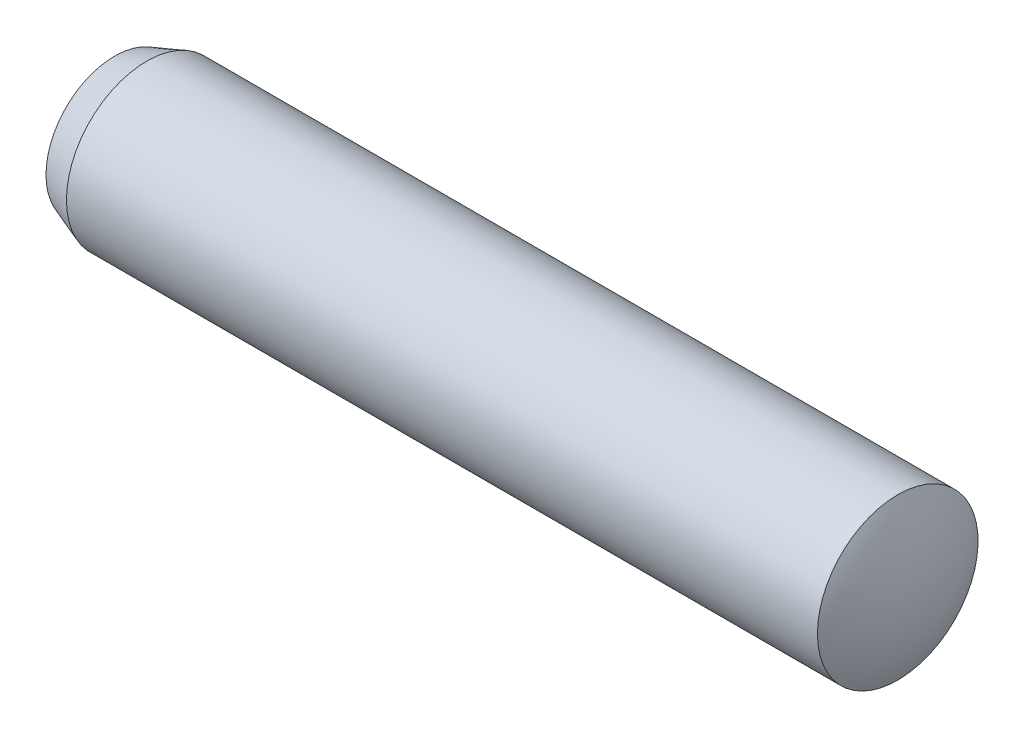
from build123d import *


with BuildPart() as part:
    # Esquisse1 → Base-R_volution (revolve)
    with BuildSketch(Plane.XY, mode=Mode.PRIVATE) as base_r_volution_sk:
        with BuildLine():
            Line((0, 0), (0, 3.417647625))
            Line((0, 3.417647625), (1.6, 4))
            Line((1.6, 4), (39, 4))
            ThreePointArc((39, 4), (39.746211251, 2.061552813), (40, 0))
            Line((40, 0), (0, 0))
        make_face()
    revolve(base_r_volution_sk.sketch.rotate(Axis((0, 0, 0), (1, 0, 0)), 90), axis=Axis((0, 0, 0), (1, 0, 0)))


solid = part.part
